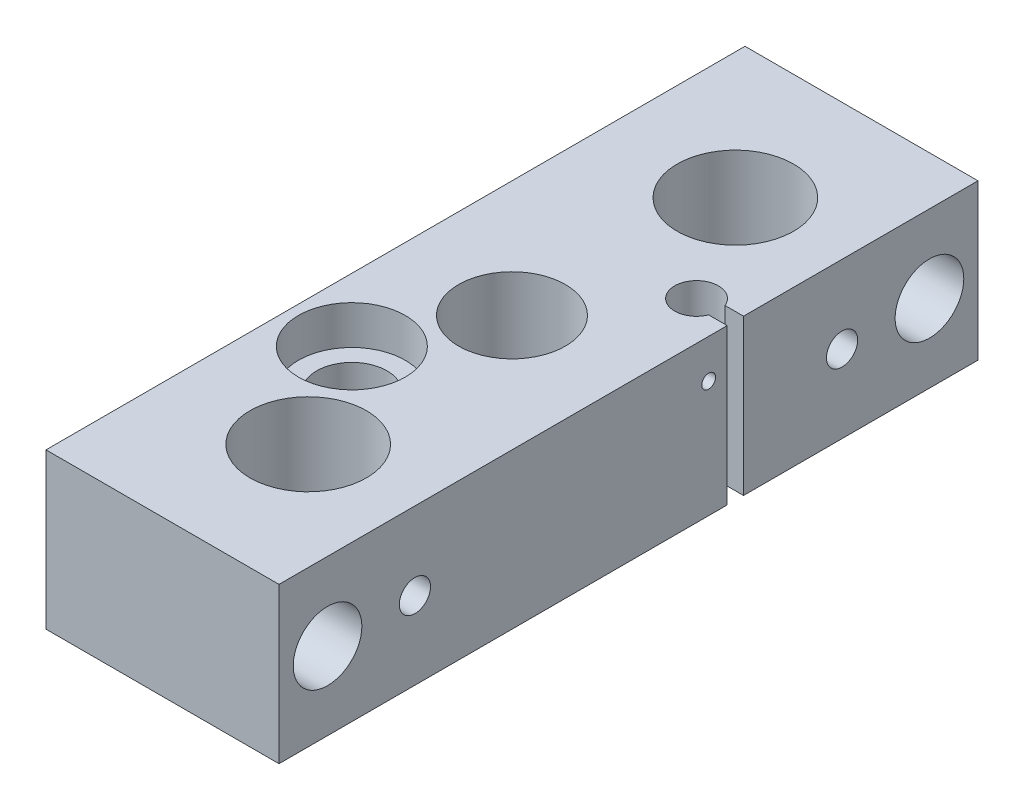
ISO-10303-21;
HEADER;
FILE_DESCRIPTION(('STEP AP214'),'2;1');
FILE_NAME('part.step','',(''),(''),'','','');
FILE_SCHEMA(('AUTOMOTIVE_DESIGN { 1 0 10303 214 1 1 1 1 }'));
ENDSEC;
DATA;
#1=APPLICATION_CONTEXT('core data for automotive mechanical design processes');
#2=APPLICATION_PROTOCOL_DEFINITION('international standard','automotive_design',2000,#1);
#3=PRODUCT_CONTEXT('',#1,'mechanical');
#4=PRODUCT('Part','Part','',(#3));
#5=PRODUCT_RELATED_PRODUCT_CATEGORY('part','',(#4));
#6=PRODUCT_DEFINITION_FORMATION('','',#4);
#7=PRODUCT_DEFINITION_CONTEXT('part definition',#1,'design');
#8=PRODUCT_DEFINITION('design','',#6,#7);
#9=PRODUCT_DEFINITION_SHAPE('','',#8);
#10=(LENGTH_UNIT() NAMED_UNIT(*) SI_UNIT(.MILLI.,.METRE.));
#11=(NAMED_UNIT(*) PLANE_ANGLE_UNIT() SI_UNIT($,.RADIAN.));
#12=(NAMED_UNIT(*) SI_UNIT($,.STERADIAN.) SOLID_ANGLE_UNIT());
#13=UNCERTAINTY_MEASURE_WITH_UNIT(LENGTH_MEASURE(1.E-05),#10,'distance_accuracy_value','');
#14=(GEOMETRIC_REPRESENTATION_CONTEXT(3) GLOBAL_UNCERTAINTY_ASSIGNED_CONTEXT((#13)) GLOBAL_UNIT_ASSIGNED_CONTEXT((#10,
#11,#12)) REPRESENTATION_CONTEXT('',''));
#15=CARTESIAN_POINT('',(0.,0.,0.));
#16=DIRECTION('',(0.,0.,1.));
#17=DIRECTION('',(1.,0.,0.));
#18=AXIS2_PLACEMENT_3D('',#15,#16,#17);
#19=CARTESIAN_POINT('',(19.05,12.7,-57.15));
#20=DIRECTION('',(-1.,0.,0.));
#21=DIRECTION('',(0.,0.,1.));
#22=AXIS2_PLACEMENT_3D('',#19,#20,#21);
#23=PLANE('',#22);
#24=CARTESIAN_POINT('',(19.05,0.,-34.925));
#25=DIRECTION('',(1.,0.,0.));
#26=DIRECTION('',(0.,0.,-1.));
#27=AXIS2_PLACEMENT_3D('',#24,#25,#26);
#28=CIRCLE('',#27,2.55269999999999);
#29=CARTESIAN_POINT('',(19.05,0.,-37.4777));
#30=VERTEX_POINT('',#29);
#31=EDGE_CURVE('E222',#30,#30,#28,.T.);
#32=ORIENTED_EDGE('',*,*,#31,.F.);
#33=EDGE_LOOP('',(#32));
#34=FACE_BOUND('',#33,.T.);
#35=CARTESIAN_POINT('',(19.05,0.,-49.2125));
#36=DIRECTION('',(1.,0.,0.));
#37=DIRECTION('',(0.,0.,-1.));
#38=AXIS2_PLACEMENT_3D('',#35,#36,#37);
#39=CIRCLE('',#38,5.61339999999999);
#40=CARTESIAN_POINT('',(19.05,0.,-54.8259));
#41=VERTEX_POINT('',#40);
#42=EDGE_CURVE('E197',#41,#41,#39,.T.);
#43=ORIENTED_EDGE('',*,*,#42,.F.);
#44=EDGE_LOOP('',(#43));
#45=FACE_BOUND('',#44,.T.);
#46=DIRECTION('',(0.,0.,-1.));
#47=VECTOR('',#46,1.);
#48=CARTESIAN_POINT('',(19.05,12.7,-57.15));
#49=LINE('',#48,#47);
#50=CARTESIAN_POINT('',(19.05,12.7,-18.8109262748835));
#51=VERTEX_POINT('',#50);
#52=CARTESIAN_POINT('',(19.05,12.7,-57.15));
#53=VERTEX_POINT('',#52);
#54=EDGE_CURVE('E380',#51,#53,#49,.T.);
#55=ORIENTED_EDGE('',*,*,#54,.F.);
#56=DIRECTION('',(0.,1.,0.));
#57=VECTOR('',#56,1.);
#58=CARTESIAN_POINT('',(19.05,-12.7,-18.8109262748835));
#59=LINE('',#58,#57);
#60=CARTESIAN_POINT('',(19.05,-12.7,-18.8109262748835));
#61=VERTEX_POINT('',#60);
#62=EDGE_CURVE('E151',#61,#51,#59,.T.);
#63=ORIENTED_EDGE('',*,*,#62,.F.);
#64=DIRECTION('',(0.,0.,-1.));
#65=VECTOR('',#64,1.);
#66=CARTESIAN_POINT('',(19.05,-12.7,-57.15));
#67=LINE('',#66,#65);
#68=CARTESIAN_POINT('',(19.05,-12.7,-57.15));
#69=VERTEX_POINT('',#68);
#70=EDGE_CURVE('E335',#61,#69,#67,.T.);
#71=ORIENTED_EDGE('',*,*,#70,.T.);
#72=DIRECTION('',(0.,-1.,0.));
#73=VECTOR('',#72,1.);
#74=CARTESIAN_POINT('',(19.05,12.7,-57.15));
#75=LINE('',#74,#73);
#76=EDGE_CURVE('E345',#53,#69,#75,.T.);
#77=ORIENTED_EDGE('',*,*,#76,.F.);
#78=EDGE_LOOP('',(#55,#63,#71,#77));
#79=FACE_BOUND('',#78,.T.);
#80=ADVANCED_FACE('F37',(#34,#45,#79),#23,.F.);
#81=CARTESIAN_POINT('',(-19.05,12.7,-57.15));
#82=DIRECTION('',(1.,0.,0.));
#83=DIRECTION('',(0.,0.,-1.));
#84=AXIS2_PLACEMENT_3D('',#81,#82,#83);
#85=PLANE('',#84);
#86=CARTESIAN_POINT('',(-19.05,0.,-49.2125));
#87=DIRECTION('',(1.,0.,0.));
#88=DIRECTION('',(0.,0.,-1.));
#89=AXIS2_PLACEMENT_3D('',#86,#87,#88);
#90=CIRCLE('',#89,4.21639999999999);
#91=CARTESIAN_POINT('',(-19.05,0.,-53.4289));
#92=VERTEX_POINT('',#91);
#93=EDGE_CURVE('E186',#92,#92,#90,.T.);
#94=ORIENTED_EDGE('',*,*,#93,.T.);
#95=EDGE_LOOP('',(#94));
#96=FACE_BOUND('',#95,.T.);
#97=CARTESIAN_POINT('',(-19.05,0.,49.2125));
#98=DIRECTION('',(1.,0.,0.));
#99=DIRECTION('',(0.,0.,-1.));
#100=AXIS2_PLACEMENT_3D('',#97,#98,#99);
#101=CIRCLE('',#100,4.21639999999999);
#102=CARTESIAN_POINT('',(-19.05,0.,44.9961));
#103=VERTEX_POINT('',#102);
#104=EDGE_CURVE('E200',#103,#103,#101,.T.);
#105=ORIENTED_EDGE('',*,*,#104,.T.);
#106=EDGE_LOOP('',(#105));
#107=FACE_BOUND('',#106,.T.);
#108=DIRECTION('',(0.,0.,1.));
#109=VECTOR('',#108,1.);
#110=CARTESIAN_POINT('',(-19.05,-12.7,-57.15));
#111=LINE('',#110,#109);
#112=CARTESIAN_POINT('',(-19.05,-12.7,-57.15));
#113=VERTEX_POINT('',#112);
#114=CARTESIAN_POINT('',(-19.05,-12.7,57.15));
#115=VERTEX_POINT('',#114);
#116=EDGE_CURVE('E372',#113,#115,#111,.T.);
#117=ORIENTED_EDGE('',*,*,#116,.T.);
#118=DIRECTION('',(0.,-1.,0.));
#119=VECTOR('',#118,1.);
#120=CARTESIAN_POINT('',(-19.05,12.7,57.15));
#121=LINE('',#120,#119);
#122=CARTESIAN_POINT('',(-19.05,12.7,57.15));
#123=VERTEX_POINT('',#122);
#124=EDGE_CURVE('E11',#123,#115,#121,.T.);
#125=ORIENTED_EDGE('',*,*,#124,.F.);
#126=DIRECTION('',(0.,0.,1.));
#127=VECTOR('',#126,1.);
#128=CARTESIAN_POINT('',(-19.05,12.7,-57.15));
#129=LINE('',#128,#127);
#130=CARTESIAN_POINT('',(-19.05,12.7,-57.15));
#131=VERTEX_POINT('',#130);
#132=EDGE_CURVE('E337',#131,#123,#129,.T.);
#133=ORIENTED_EDGE('',*,*,#132,.F.);
#134=DIRECTION('',(0.,-1.,0.));
#135=VECTOR('',#134,1.);
#136=CARTESIAN_POINT('',(-19.05,12.7,-57.15));
#137=LINE('',#136,#135);
#138=EDGE_CURVE('E343',#131,#113,#137,.T.);
#139=ORIENTED_EDGE('',*,*,#138,.T.);
#140=EDGE_LOOP('',(#117,#125,#133,#139));
#141=FACE_BOUND('',#140,.T.);
#142=ADVANCED_FACE('F39',(#96,#107,#141),#85,.F.);
#143=CARTESIAN_POINT('',(-19.05,12.7,57.15));
#144=DIRECTION('',(0.,0.,-1.));
#145=DIRECTION('',(-1.,0.,0.));
#146=AXIS2_PLACEMENT_3D('',#143,#144,#145);
#147=PLANE('',#146);
#148=DIRECTION('',(1.,0.,0.));
#149=VECTOR('',#148,1.);
#150=CARTESIAN_POINT('',(-19.05,-12.7,57.15));
#151=LINE('',#150,#149);
#152=CARTESIAN_POINT('',(19.05,-12.7,57.15));
#153=VERTEX_POINT('',#152);
#154=EDGE_CURVE('E339',#115,#153,#151,.T.);
#155=ORIENTED_EDGE('',*,*,#154,.T.);
#156=DIRECTION('',(0.,-1.,0.));
#157=VECTOR('',#156,1.);
#158=CARTESIAN_POINT('',(19.05,12.7,57.15));
#159=LINE('',#158,#157);
#160=CARTESIAN_POINT('',(19.05,12.7,57.15));
#161=VERTEX_POINT('',#160);
#162=EDGE_CURVE('E50',#161,#153,#159,.T.);
#163=ORIENTED_EDGE('',*,*,#162,.F.);
#164=DIRECTION('',(1.,0.,0.));
#165=VECTOR('',#164,1.);
#166=CARTESIAN_POINT('',(-19.05,12.7,57.15));
#167=LINE('',#166,#165);
#168=EDGE_CURVE('E95',#123,#161,#167,.T.);
#169=ORIENTED_EDGE('',*,*,#168,.F.);
#170=ORIENTED_EDGE('',*,*,#124,.T.);
#171=EDGE_LOOP('',(#155,#163,#169,#170));
#172=FACE_BOUND('',#171,.T.);
#173=ADVANCED_FACE('F312',(#172),#147,.F.);
#174=CARTESIAN_POINT('',(19.05,6.35,-13.1064));
#175=DIRECTION('',(1.,0.,0.));
#176=DIRECTION('',(0.,0.,-1.));
#177=AXIS2_PLACEMENT_3D('',#174,#175,#176);
#178=CIRCLE('',#177,1.13029999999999);
#179=CARTESIAN_POINT('',(19.05,6.35,-14.2367));
#180=VERTEX_POINT('',#179);
#181=EDGE_CURVE('E157',#180,#180,#178,.T.);
#182=ORIENTED_EDGE('',*,*,#181,.F.);
#183=EDGE_LOOP('',(#182));
#184=FACE_BOUND('',#183,.T.);
#185=CARTESIAN_POINT('',(19.05,0.,49.2125));
#186=DIRECTION('',(1.,0.,0.));
#187=DIRECTION('',(0.,0.,-1.));
#188=AXIS2_PLACEMENT_3D('',#185,#186,#187);
#189=CIRCLE('',#188,5.61339999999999);
#190=CARTESIAN_POINT('',(19.05,0.,43.5991));
#191=VERTEX_POINT('',#190);
#192=EDGE_CURVE('E209',#191,#191,#189,.T.);
#193=ORIENTED_EDGE('',*,*,#192,.F.);
#194=EDGE_LOOP('',(#193));
#195=FACE_BOUND('',#194,.T.);
#196=CARTESIAN_POINT('',(19.05,0.,34.925));
#197=DIRECTION('',(1.,0.,0.));
#198=DIRECTION('',(0.,0.,-1.));
#199=AXIS2_PLACEMENT_3D('',#196,#197,#198);
#200=CIRCLE('',#199,2.55269999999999);
#201=CARTESIAN_POINT('',(19.05,0.,32.3723));
#202=VERTEX_POINT('',#201);
#203=EDGE_CURVE('E212',#202,#202,#200,.T.);
#204=ORIENTED_EDGE('',*,*,#203,.F.);
#205=EDGE_LOOP('',(#204));
#206=FACE_BOUND('',#205,.T.);
#207=CARTESIAN_POINT('',(19.05,-12.7,-16.1394737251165));
#208=VERTEX_POINT('',#207);
#209=EDGE_CURVE('E332',#153,#208,#67,.T.);
#210=ORIENTED_EDGE('',*,*,#209,.T.);
#211=DIRECTION('',(0.,1.,0.));
#212=VECTOR('',#211,1.);
#213=CARTESIAN_POINT('',(19.05,-12.7,-16.1394737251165));
#214=LINE('',#213,#212);
#215=CARTESIAN_POINT('',(19.05,12.7,-16.1394737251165));
#216=VERTEX_POINT('',#215);
#217=EDGE_CURVE('E58',#208,#216,#214,.T.);
#218=ORIENTED_EDGE('',*,*,#217,.T.);
#219=EDGE_CURVE('E381',#161,#216,#49,.T.);
#220=ORIENTED_EDGE('',*,*,#219,.F.);
#221=ORIENTED_EDGE('',*,*,#162,.T.);
#222=EDGE_LOOP('',(#210,#218,#220,#221));
#223=FACE_BOUND('',#222,.T.);
#224=ADVANCED_FACE('F308',(#184,#195,#206,#223),#23,.F.);
#225=CARTESIAN_POINT('',(-19.05,12.7,-57.15));
#226=DIRECTION('',(0.,0.,1.));
#227=DIRECTION('',(1.,0.,0.));
#228=AXIS2_PLACEMENT_3D('',#225,#226,#227);
#229=PLANE('',#228);
#230=DIRECTION('',(-1.,0.,0.));
#231=VECTOR('',#230,1.);
#232=CARTESIAN_POINT('',(-19.05,-12.7,-57.15));
#233=LINE('',#232,#231);
#234=EDGE_CURVE('E88',#69,#113,#233,.T.);
#235=ORIENTED_EDGE('',*,*,#234,.T.);
#236=ORIENTED_EDGE('',*,*,#138,.F.);
#237=DIRECTION('',(-1.,0.,0.));
#238=VECTOR('',#237,1.);
#239=CARTESIAN_POINT('',(-19.05,12.7,-57.15));
#240=LINE('',#239,#238);
#241=EDGE_CURVE('E67',#53,#131,#240,.T.);
#242=ORIENTED_EDGE('',*,*,#241,.F.);
#243=ORIENTED_EDGE('',*,*,#76,.T.);
#244=EDGE_LOOP('',(#235,#236,#242,#243));
#245=FACE_BOUND('',#244,.T.);
#246=ADVANCED_FACE('F318',(#245),#229,.F.);
#247=CARTESIAN_POINT('',(-19.05,12.7,-57.15));
#248=DIRECTION('',(0.,1.,0.));
#249=DIRECTION('',(0.,0.,1.));
#250=AXIS2_PLACEMENT_3D('',#247,#248,#249);
#251=PLANE('',#250);
#252=DIRECTION('',(-1.,0.,0.));
#253=VECTOR('',#252,1.);
#254=CARTESIAN_POINT('',(19.05,12.7,-18.8109262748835));
#255=LINE('',#254,#253);
#256=CARTESIAN_POINT('',(16.0202041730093,12.7,-18.8109262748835));
#257=VERTEX_POINT('',#256);
#258=EDGE_CURVE('E140',#51,#257,#255,.T.);
#259=ORIENTED_EDGE('',*,*,#258,.F.);
#260=ORIENTED_EDGE('',*,*,#54,.T.);
#261=ORIENTED_EDGE('',*,*,#241,.T.);
#262=ORIENTED_EDGE('',*,*,#132,.T.);
#263=ORIENTED_EDGE('',*,*,#168,.T.);
#264=ORIENTED_EDGE('',*,*,#219,.T.);
#265=DIRECTION('',(1.,0.,0.));
#266=VECTOR('',#265,1.);
#267=CARTESIAN_POINT('',(19.05,12.7,-16.1394737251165));
#268=LINE('',#267,#266);
#269=CARTESIAN_POINT('',(16.0202041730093,12.7,-16.1394737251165));
#270=VERTEX_POINT('',#269);
#271=EDGE_CURVE('E143',#270,#216,#268,.T.);
#272=ORIENTED_EDGE('',*,*,#271,.F.);
#273=CARTESIAN_POINT('',(12.7,12.7,-17.4752));
#274=DIRECTION('',(0.,1.,0.));
#275=DIRECTION('',(0.,0.,1.));
#276=AXIS2_PLACEMENT_3D('',#273,#274,#275);
#277=CIRCLE('',#276,3.57881550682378);
#278=EDGE_CURVE('E128',#257,#270,#277,.T.);
#279=ORIENTED_EDGE('',*,*,#278,.F.);
#280=EDGE_LOOP('',(#259,#260,#261,#262,#263,#264,#272,#279));
#281=FACE_BOUND('',#280,.T.);
#282=CARTESIAN_POINT('',(0.,12.7,0.));
#283=DIRECTION('',(0.,1.,0.));
#284=DIRECTION('',(0.,0.,1.));
#285=AXIS2_PLACEMENT_3D('',#282,#283,#284);
#286=CIRCLE('',#285,8.73125);
#287=CARTESIAN_POINT('',(0.,12.7,8.73125));
#288=VERTEX_POINT('',#287);
#289=EDGE_CURVE('E174',#288,#288,#286,.T.);
#290=ORIENTED_EDGE('',*,*,#289,.F.);
#291=EDGE_LOOP('',(#290));
#292=FACE_BOUND('',#291,.T.);
#293=CARTESIAN_POINT('',(-8.7122,12.7,17.4752));
#294=DIRECTION('',(0.,1.,0.));
#295=DIRECTION('',(0.,0.,1.));
#296=AXIS2_PLACEMENT_3D('',#293,#294,#295);
#297=CIRCLE('',#296,8.73760000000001);
#298=CARTESIAN_POINT('',(-8.7122,12.7,26.2128));
#299=VERTEX_POINT('',#298);
#300=EDGE_CURVE('E182',#299,#299,#297,.T.);
#301=ORIENTED_EDGE('',*,*,#300,.F.);
#302=EDGE_LOOP('',(#301));
#303=FACE_BOUND('',#302,.T.);
#304=CARTESIAN_POINT('',(1.6002,12.7,-34.925));
#305=DIRECTION('',(0.,1.,0.));
#306=DIRECTION('',(0.,0.,-1.));
#307=AXIS2_PLACEMENT_3D('',#304,#305,#306);
#308=CIRCLE('',#307,9.525);
#309=CARTESIAN_POINT('',(1.6002,12.7,-44.45));
#310=VERTEX_POINT('',#309);
#311=EDGE_CURVE('E363',#310,#310,#308,.T.);
#312=ORIENTED_EDGE('',*,*,#311,.F.);
#313=EDGE_LOOP('',(#312));
#314=FACE_BOUND('',#313,.T.);
#315=CARTESIAN_POINT('',(1.6002,12.7,34.925));
#316=DIRECTION('',(0.,1.,0.));
#317=DIRECTION('',(0.,0.,1.));
#318=AXIS2_PLACEMENT_3D('',#315,#316,#317);
#319=CIRCLE('',#318,9.525);
#320=CARTESIAN_POINT('',(1.6002,12.7,44.45));
#321=VERTEX_POINT('',#320);
#322=EDGE_CURVE('E366',#321,#321,#319,.T.);
#323=ORIENTED_EDGE('',*,*,#322,.F.);
#324=EDGE_LOOP('',(#323));
#325=FACE_BOUND('',#324,.T.);
#326=ADVANCED_FACE('F324',(#281,#292,#303,#314,#325),#251,.T.);
#327=CARTESIAN_POINT('',(-19.05,-12.7,-57.15));
#328=DIRECTION('',(0.,1.,0.));
#329=DIRECTION('',(0.,0.,1.));
#330=AXIS2_PLACEMENT_3D('',#327,#328,#329);
#331=PLANE('',#330);
#332=CARTESIAN_POINT('',(0.,-12.7,0.));
#333=DIRECTION('',(0.,-1.,0.));
#334=DIRECTION('',(0.,0.,-1.));
#335=AXIS2_PLACEMENT_3D('',#332,#333,#334);
#336=CIRCLE('',#335,4.74472);
#337=CARTESIAN_POINT('',(0.,-12.7,-4.74472));
#338=VERTEX_POINT('',#337);
#339=EDGE_CURVE('E166',#338,#338,#336,.T.);
#340=ORIENTED_EDGE('',*,*,#339,.F.);
#341=EDGE_LOOP('',(#340));
#342=FACE_BOUND('',#341,.T.);
#343=CARTESIAN_POINT('',(-8.7122,-12.7,17.4752));
#344=DIRECTION('',(0.,1.,0.));
#345=DIRECTION('',(0.,0.,1.));
#346=AXIS2_PLACEMENT_3D('',#343,#344,#345);
#347=CIRCLE('',#346,5.75436999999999);
#348=CARTESIAN_POINT('',(-8.7122,-12.7,23.22957));
#349=VERTEX_POINT('',#348);
#350=EDGE_CURVE('E173',#349,#349,#347,.T.);
#351=ORIENTED_EDGE('',*,*,#350,.T.);
#352=EDGE_LOOP('',(#351));
#353=FACE_BOUND('',#352,.T.);
#354=CARTESIAN_POINT('',(1.6002,-12.7,-34.925));
#355=DIRECTION('',(0.,1.,0.));
#356=DIRECTION('',(0.,0.,-1.));
#357=AXIS2_PLACEMENT_3D('',#354,#355,#356);
#358=CIRCLE('',#357,9.525);
#359=CARTESIAN_POINT('',(1.6002,-12.7,-44.45));
#360=VERTEX_POINT('',#359);
#361=EDGE_CURVE('E369',#360,#360,#358,.T.);
#362=ORIENTED_EDGE('',*,*,#361,.T.);
#363=EDGE_LOOP('',(#362));
#364=FACE_BOUND('',#363,.T.);
#365=CARTESIAN_POINT('',(1.6002,-12.7,34.925));
#366=DIRECTION('',(0.,1.,0.));
#367=DIRECTION('',(0.,0.,1.));
#368=AXIS2_PLACEMENT_3D('',#365,#366,#367);
#369=CIRCLE('',#368,9.525);
#370=CARTESIAN_POINT('',(1.6002,-12.7,44.45));
#371=VERTEX_POINT('',#370);
#372=EDGE_CURVE('E368',#371,#371,#369,.T.);
#373=ORIENTED_EDGE('',*,*,#372,.T.);
#374=EDGE_LOOP('',(#373));
#375=FACE_BOUND('',#374,.T.);
#376=ORIENTED_EDGE('',*,*,#70,.F.);
#377=DIRECTION('',(-1.,0.,0.));
#378=VECTOR('',#377,1.);
#379=CARTESIAN_POINT('',(19.05,-12.7,-18.8109262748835));
#380=LINE('',#379,#378);
#381=CARTESIAN_POINT('',(16.0202041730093,-12.7,-18.8109262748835));
#382=VERTEX_POINT('',#381);
#383=EDGE_CURVE('E130',#61,#382,#380,.T.);
#384=ORIENTED_EDGE('',*,*,#383,.T.);
#385=CARTESIAN_POINT('',(12.7,-12.7,-17.4752));
#386=DIRECTION('',(0.,1.,0.));
#387=DIRECTION('',(0.,0.,1.));
#388=AXIS2_PLACEMENT_3D('',#385,#386,#387);
#389=CIRCLE('',#388,3.57881550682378);
#390=CARTESIAN_POINT('',(16.0202041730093,-12.7,-16.1394737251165));
#391=VERTEX_POINT('',#390);
#392=EDGE_CURVE('E125',#382,#391,#389,.T.);
#393=ORIENTED_EDGE('',*,*,#392,.T.);
#394=DIRECTION('',(1.,0.,0.));
#395=VECTOR('',#394,1.);
#396=CARTESIAN_POINT('',(19.05,-12.7,-16.1394737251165));
#397=LINE('',#396,#395);
#398=EDGE_CURVE('E132',#391,#208,#397,.T.);
#399=ORIENTED_EDGE('',*,*,#398,.T.);
#400=ORIENTED_EDGE('',*,*,#209,.F.);
#401=ORIENTED_EDGE('',*,*,#154,.F.);
#402=ORIENTED_EDGE('',*,*,#116,.F.);
#403=ORIENTED_EDGE('',*,*,#234,.F.);
#404=EDGE_LOOP('',(#376,#384,#393,#399,#400,#401,#402,#403));
#405=FACE_BOUND('',#404,.T.);
#406=ADVANCED_FACE('F139',(#342,#353,#364,#375,#405),#331,.F.);
#407=CARTESIAN_POINT('',(1.6002,-12.7,34.925));
#408=DIRECTION('',(0.,1.,0.));
#409=DIRECTION('',(0.,0.,1.));
#410=AXIS2_PLACEMENT_3D('',#407,#408,#409);
#411=CYLINDRICAL_SURFACE('',#410,9.525);
#412=CARTESIAN_POINT('',(10.7767651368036,0.,32.3723));
#413=CARTESIAN_POINT('',(10.7767675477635,0.140595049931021,32.3723033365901));
#414=CARTESIAN_POINT('',(10.7800315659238,0.281225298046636,32.3839548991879));
#415=CARTESIAN_POINT('',(10.7926954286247,0.558422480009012,32.4301637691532));
#416=CARTESIAN_POINT('',(10.8020983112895,0.694987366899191,32.4647324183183));
#417=CARTESIAN_POINT('',(10.8259001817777,0.960003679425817,32.5555560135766));
#418=CARTESIAN_POINT('',(10.8402920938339,1.08846629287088,32.6117802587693));
#419=CARTESIAN_POINT('',(10.8724413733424,1.33415616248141,32.7442226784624));
#420=CARTESIAN_POINT('',(10.8901990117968,1.45138251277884,32.820442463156));
#421=CARTESIAN_POINT('',(10.9275816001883,1.6742337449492,32.9927714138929));
#422=CARTESIAN_POINT('',(10.9472399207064,1.77953274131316,33.0892948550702));
#423=CARTESIAN_POINT('',(10.9859209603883,1.97265853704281,33.2986003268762));
#424=CARTESIAN_POINT('',(11.0049436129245,2.06048350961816,33.4113840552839));
#425=CARTESIAN_POINT('',(11.040582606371,2.21752928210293,33.6522705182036));
#426=CARTESIAN_POINT('',(11.057154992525,2.28642578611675,33.7805917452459));
#427=CARTESIAN_POINT('',(11.0856431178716,2.4015434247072,34.0475146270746));
#428=CARTESIAN_POINT('',(11.0975596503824,2.44776842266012,34.1861145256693));
#429=CARTESIAN_POINT('',(11.1151574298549,2.51517528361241,34.4662585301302));
#430=CARTESIAN_POINT('',(11.1209765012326,2.53691157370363,34.6076604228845));
#431=CARTESIAN_POINT('',(11.1262057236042,2.55646866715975,34.892215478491));
#432=CARTESIAN_POINT('',(11.1256169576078,2.55429351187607,35.0353683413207));
#433=CARTESIAN_POINT('',(11.1181976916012,2.52647919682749,35.31550156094));
#434=CARTESIAN_POINT('',(11.1115265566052,2.50143909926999,35.4525462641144));
#435=CARTESIAN_POINT('',(11.0928803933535,2.42957391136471,35.7204124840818));
#436=CARTESIAN_POINT('',(11.0809050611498,2.38274757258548,35.8512336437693));
#437=CARTESIAN_POINT('',(11.0527602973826,2.26818204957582,36.1044645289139));
#438=CARTESIAN_POINT('',(11.0365500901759,2.20023825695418,36.2267769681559));
#439=CARTESIAN_POINT('',(11.0016811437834,2.04552371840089,36.4584680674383));
#440=CARTESIAN_POINT('',(10.9830219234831,1.95874927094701,36.5678441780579));
#441=CARTESIAN_POINT('',(10.9445936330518,1.76565925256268,36.7741335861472));
#442=CARTESIAN_POINT('',(10.9248080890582,1.65882130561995,36.8705554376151));
#443=CARTESIAN_POINT('',(10.8868783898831,1.43028755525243,37.0442342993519));
#444=CARTESIAN_POINT('',(10.868734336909,1.30859082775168,37.1214901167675));
#445=CARTESIAN_POINT('',(10.8360753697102,1.05271982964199,37.2550230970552));
#446=CARTESIAN_POINT('',(10.8215839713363,0.91847197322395,37.3111654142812));
#447=CARTESIAN_POINT('',(10.7981626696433,0.641957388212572,37.3999218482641));
#448=CARTESIAN_POINT('',(10.7892313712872,0.499692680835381,37.4325418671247));
#449=CARTESIAN_POINT('',(10.7782390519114,0.21578199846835,37.4724778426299));
#450=CARTESIAN_POINT('',(10.7759789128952,0.0742468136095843,37.4805274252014));
#451=CARTESIAN_POINT('',(10.778039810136,-0.208147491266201,37.4731163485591));
#452=CARTESIAN_POINT('',(10.782360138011,-0.349006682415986,37.4576582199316));
#453=CARTESIAN_POINT('',(10.7969027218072,-0.623215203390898,37.4043175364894));
#454=CARTESIAN_POINT('',(10.8070085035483,-0.756657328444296,37.3668771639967));
#455=CARTESIAN_POINT('',(10.8318692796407,-1.01536753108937,37.2711325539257));
#456=CARTESIAN_POINT('',(10.8466248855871,-1.14063453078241,37.2128255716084));
#457=CARTESIAN_POINT('',(10.8795305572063,-1.38250471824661,37.0755172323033));
#458=CARTESIAN_POINT('',(10.8977486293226,-1.49885423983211,36.9960857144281));
#459=CARTESIAN_POINT('',(10.935367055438,-1.71684210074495,36.8193154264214));
#460=CARTESIAN_POINT('',(10.9547676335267,-1.81847763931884,36.7219732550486));
#461=CARTESIAN_POINT('',(10.9932514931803,-2.0072040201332,36.5087493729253));
#462=CARTESIAN_POINT('',(11.0123089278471,-2.09378293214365,36.392408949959));
#463=CARTESIAN_POINT('',(11.0473777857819,-2.24618302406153,36.1464206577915));
#464=CARTESIAN_POINT('',(11.0633893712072,-2.31200530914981,36.0167734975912));
#465=CARTESIAN_POINT('',(11.0904592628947,-2.42041735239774,35.7487646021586));
#466=CARTESIAN_POINT('',(11.1015545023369,-2.463180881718,35.6104770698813));
#467=CARTESIAN_POINT('',(11.1177041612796,-2.52476398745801,35.3283365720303));
#468=CARTESIAN_POINT('',(11.122759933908,-2.54358892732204,35.1844848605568));
#469=CARTESIAN_POINT('',(11.1261964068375,-2.55642167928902,34.9000800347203));
#470=CARTESIAN_POINT('',(11.1247790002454,-2.55118007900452,34.7595627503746));
#471=CARTESIAN_POINT('',(11.11588567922,-2.51777328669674,34.4814865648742));
#472=CARTESIAN_POINT('',(11.1084099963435,-2.48960897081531,34.3439275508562));
#473=CARTESIAN_POINT('',(11.0882808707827,-2.41158232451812,34.0765851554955));
#474=CARTESIAN_POINT('',(11.07566412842,-2.3618736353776,33.9467539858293));
#475=CARTESIAN_POINT('',(11.046571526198,-2.24230638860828,33.6972008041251));
#476=CARTESIAN_POINT('',(11.0300951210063,-2.17244498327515,33.5774802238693));
#477=CARTESIAN_POINT('',(10.9944923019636,-2.0123662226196,33.3480577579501));
#478=CARTESIAN_POINT('',(10.97530656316,-1.92165220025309,33.2387116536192));
#479=CARTESIAN_POINT('',(10.9366854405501,-1.72338339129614,33.0365401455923));
#480=CARTESIAN_POINT('',(10.9172499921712,-1.61582416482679,32.9437191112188));
#481=CARTESIAN_POINT('',(10.8798310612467,-1.38403596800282,32.7751843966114));
#482=CARTESIAN_POINT('',(10.8618895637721,-1.25948905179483,32.6998978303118));
#483=CARTESIAN_POINT('',(10.8300853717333,-0.999039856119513,32.5714390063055));
#484=CARTESIAN_POINT('',(10.816220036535,-0.863145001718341,32.5182524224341));
#485=CARTESIAN_POINT('',(10.7960427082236,-0.606479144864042,32.4423855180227));
#486=CARTESIAN_POINT('',(10.7888724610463,-0.486810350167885,32.4161655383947));
#487=CARTESIAN_POINT('',(10.7792329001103,-0.244769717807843,32.3811223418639));
#488=CARTESIAN_POINT('',(10.7767630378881,-0.122398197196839,32.3722970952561));
#489=CARTESIAN_POINT('',(10.7767651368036,0.,32.3723));
#490=B_SPLINE_CURVE_WITH_KNOTS('',3,(#412,#413,#414,#415,#416,#417,#418,#419,#420,#421,#422,
#423,#424,#425,#426,#427,#428,#429,#430,#431,#432,#433,#434,#435,#436,#437,#438,#439,#440,#441,
#442,#443,#444,#445,#446,#447,#448,#449,#450,#451,#452,#453,#454,#455,#456,#457,#458,#459,#460,
#461,#462,#463,#464,#465,#466,#467,#468,#469,#470,#471,#472,#473,#474,#475,#476,#477,#478,#479,
#480,#481,#482,#483,#484,#485,#486,#487,#488,#489),.UNSPECIFIED.,.T.,.F.,(4,2,2,2,2,2,2,2,2,2,2,
2,2,2,2,2,2,2,2,2,2,2,2,2,2,2,2,2,2,2,2,2,2,2,2,2,2,2,4),(0.,0.421335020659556,
0.842878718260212,1.26382698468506,1.68480915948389,2.11540048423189,2.54603680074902,
2.98364660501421,3.42118181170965,3.84859855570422,4.27594306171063,4.6924026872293,
5.10888618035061,5.52953789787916,5.95027237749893,6.38404937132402,6.81785335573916,
7.25438267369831,7.69080242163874,8.11405736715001,8.53726675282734,8.95224141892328,
9.36727068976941,9.79150173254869,10.2158134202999,10.6525267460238,11.0892168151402,
11.5225682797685,11.9558226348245,12.3756580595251,12.7954774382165,13.2123509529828,
13.6292834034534,14.0574224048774,14.4856744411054,14.9234656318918,15.3609725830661,
15.7278181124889,16.0946208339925),.UNSPECIFIED.);
#491=CARTESIAN_POINT('',(10.7767651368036,0.,32.3723));
#492=VERTEX_POINT('',#491);
#493=EDGE_CURVE('E215',#492,#492,#490,.T.);
#494=ORIENTED_EDGE('',*,*,#493,.T.);
#495=EDGE_LOOP('',(#494));
#496=FACE_BOUND('',#495,.T.);
#497=ORIENTED_EDGE('',*,*,#372,.F.);
#498=EDGE_LOOP('',(#497));
#499=FACE_BOUND('',#498,.T.);
#500=ORIENTED_EDGE('',*,*,#322,.T.);
#501=EDGE_LOOP('',(#500));
#502=FACE_BOUND('',#501,.T.);
#503=ADVANCED_FACE('F407',(#496,#499,#502),#411,.F.);
#504=CARTESIAN_POINT('',(1.6002,-12.7,-34.925));
#505=DIRECTION('',(0.,1.,0.));
#506=DIRECTION('',(0.,0.,1.));
#507=AXIS2_PLACEMENT_3D('',#504,#505,#506);
#508=CYLINDRICAL_SURFACE('',#507,9.525);
#509=CARTESIAN_POINT('',(10.7767651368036,0.,-37.4777));
#510=CARTESIAN_POINT('',(10.7767675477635,0.140595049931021,-37.4776966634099));
#511=CARTESIAN_POINT('',(10.7800315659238,0.281225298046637,-37.4660451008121));
#512=CARTESIAN_POINT('',(10.7926954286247,0.558422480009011,-37.4198362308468));
#513=CARTESIAN_POINT('',(10.8020983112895,0.694987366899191,-37.3852675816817));
#514=CARTESIAN_POINT('',(10.8259001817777,0.960003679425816,-37.2944439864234));
#515=CARTESIAN_POINT('',(10.8402920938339,1.08846629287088,-37.2382197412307));
#516=CARTESIAN_POINT('',(10.8724413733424,1.33415616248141,-37.1057773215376));
#517=CARTESIAN_POINT('',(10.8901990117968,1.45138251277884,-37.029557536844));
#518=CARTESIAN_POINT('',(10.9275816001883,1.6742337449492,-36.8572285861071));
#519=CARTESIAN_POINT('',(10.9472399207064,1.77953274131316,-36.7607051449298));
#520=CARTESIAN_POINT('',(10.9859209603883,1.97265853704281,-36.5513996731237));
#521=CARTESIAN_POINT('',(11.0049436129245,2.06048350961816,-36.4386159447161));
#522=CARTESIAN_POINT('',(11.040582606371,2.21752928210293,-36.1977294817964));
#523=CARTESIAN_POINT('',(11.057154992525,2.28642578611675,-36.0694082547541));
#524=CARTESIAN_POINT('',(11.0856431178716,2.4015434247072,-35.8024853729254));
#525=CARTESIAN_POINT('',(11.0975596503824,2.44776842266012,-35.6638854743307));
#526=CARTESIAN_POINT('',(11.1151574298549,2.51517528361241,-35.3837414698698));
#527=CARTESIAN_POINT('',(11.1209765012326,2.53691157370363,-35.2423395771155));
#528=CARTESIAN_POINT('',(11.1262057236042,2.55646866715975,-34.957784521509));
#529=CARTESIAN_POINT('',(11.1256169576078,2.55429351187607,-34.8146316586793));
#530=CARTESIAN_POINT('',(11.1181976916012,2.52647919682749,-34.53449843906));
#531=CARTESIAN_POINT('',(11.1115265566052,2.50143909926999,-34.3974537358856));
#532=CARTESIAN_POINT('',(11.0928803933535,2.42957391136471,-34.1295875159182));
#533=CARTESIAN_POINT('',(11.0809050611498,2.38274757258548,-33.9987663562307));
#534=CARTESIAN_POINT('',(11.0527602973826,2.26818204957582,-33.7455354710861));
#535=CARTESIAN_POINT('',(11.0365500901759,2.20023825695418,-33.6232230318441));
#536=CARTESIAN_POINT('',(11.0016811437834,2.04552371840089,-33.3915319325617));
#537=CARTESIAN_POINT('',(10.9830219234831,1.95874927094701,-33.2821558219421));
#538=CARTESIAN_POINT('',(10.9445936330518,1.76565925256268,-33.0758664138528));
#539=CARTESIAN_POINT('',(10.9248080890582,1.65882130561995,-32.9794445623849));
#540=CARTESIAN_POINT('',(10.8868783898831,1.43028755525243,-32.8057657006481));
#541=CARTESIAN_POINT('',(10.868734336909,1.30859082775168,-32.7285098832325));
#542=CARTESIAN_POINT('',(10.8360753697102,1.05271982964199,-32.5949769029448));
#543=CARTESIAN_POINT('',(10.8215839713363,0.91847197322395,-32.5388345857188));
#544=CARTESIAN_POINT('',(10.7981626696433,0.641957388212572,-32.4500781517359));
#545=CARTESIAN_POINT('',(10.7892313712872,0.499692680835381,-32.4174581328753));
#546=CARTESIAN_POINT('',(10.7782390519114,0.21578199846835,-32.3775221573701));
#547=CARTESIAN_POINT('',(10.7759789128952,0.0742468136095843,-32.3694725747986));
#548=CARTESIAN_POINT('',(10.778039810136,-0.208147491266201,-32.3768836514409));
#549=CARTESIAN_POINT('',(10.782360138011,-0.349006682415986,-32.3923417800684));
#550=CARTESIAN_POINT('',(10.7969027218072,-0.623215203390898,-32.4456824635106));
#551=CARTESIAN_POINT('',(10.8070085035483,-0.756657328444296,-32.4831228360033));
#552=CARTESIAN_POINT('',(10.8318692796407,-1.01536753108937,-32.5788674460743));
#553=CARTESIAN_POINT('',(10.8466248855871,-1.14063453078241,-32.6371744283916));
#554=CARTESIAN_POINT('',(10.8795305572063,-1.38250471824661,-32.7744827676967));
#555=CARTESIAN_POINT('',(10.8977486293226,-1.4988542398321,-32.8539142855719));
#556=CARTESIAN_POINT('',(10.935367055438,-1.71684210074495,-33.0306845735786));
#557=CARTESIAN_POINT('',(10.9547676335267,-1.81847763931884,-33.1280267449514));
#558=CARTESIAN_POINT('',(10.9932514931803,-2.0072040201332,-33.3412506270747));
#559=CARTESIAN_POINT('',(11.0123089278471,-2.09378293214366,-33.457591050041));
#560=CARTESIAN_POINT('',(11.0473777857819,-2.24618302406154,-33.7035793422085));
#561=CARTESIAN_POINT('',(11.0633893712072,-2.31200530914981,-33.8332265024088));
#562=CARTESIAN_POINT('',(11.0904592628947,-2.42041735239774,-34.1012353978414));
#563=CARTESIAN_POINT('',(11.1015545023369,-2.463180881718,-34.2395229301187));
#564=CARTESIAN_POINT('',(11.1177041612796,-2.52476398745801,-34.5216634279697));
#565=CARTESIAN_POINT('',(11.122759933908,-2.54358892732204,-34.6655151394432));
#566=CARTESIAN_POINT('',(11.1261964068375,-2.55642167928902,-34.9499199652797));
#567=CARTESIAN_POINT('',(11.1247790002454,-2.55118007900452,-35.0904372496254));
#568=CARTESIAN_POINT('',(11.11588567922,-2.51777328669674,-35.3685134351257));
#569=CARTESIAN_POINT('',(11.1084099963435,-2.48960897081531,-35.5060724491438));
#570=CARTESIAN_POINT('',(11.0882808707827,-2.41158232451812,-35.7734148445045));
#571=CARTESIAN_POINT('',(11.07566412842,-2.3618736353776,-35.9032460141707));
#572=CARTESIAN_POINT('',(11.046571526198,-2.24230638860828,-36.1527991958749));
#573=CARTESIAN_POINT('',(11.0300951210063,-2.17244498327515,-36.2725197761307));
#574=CARTESIAN_POINT('',(10.9944923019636,-2.0123662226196,-36.5019422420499));
#575=CARTESIAN_POINT('',(10.97530656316,-1.92165220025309,-36.6112883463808));
#576=CARTESIAN_POINT('',(10.9366854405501,-1.72338339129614,-36.8134598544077));
#577=CARTESIAN_POINT('',(10.9172499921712,-1.61582416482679,-36.9062808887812));
#578=CARTESIAN_POINT('',(10.8798310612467,-1.38403596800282,-37.0748156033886));
#579=CARTESIAN_POINT('',(10.8618895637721,-1.25948905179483,-37.1501021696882));
#580=CARTESIAN_POINT('',(10.8300853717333,-0.999039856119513,-37.2785609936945));
#581=CARTESIAN_POINT('',(10.816220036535,-0.863145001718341,-37.3317475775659));
#582=CARTESIAN_POINT('',(10.7960427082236,-0.606479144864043,-37.4076144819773));
#583=CARTESIAN_POINT('',(10.7888724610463,-0.486810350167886,-37.4338344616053));
#584=CARTESIAN_POINT('',(10.7792329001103,-0.244769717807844,-37.4688776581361));
#585=CARTESIAN_POINT('',(10.7767630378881,-0.122398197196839,-37.4777029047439));
#586=CARTESIAN_POINT('',(10.7767651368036,0.,-37.4777));
#587=B_SPLINE_CURVE_WITH_KNOTS('',3,(#509,#510,#511,#512,#513,#514,#515,#516,#517,#518,#519,
#520,#521,#522,#523,#524,#525,#526,#527,#528,#529,#530,#531,#532,#533,#534,#535,#536,#537,#538,
#539,#540,#541,#542,#543,#544,#545,#546,#547,#548,#549,#550,#551,#552,#553,#554,#555,#556,#557,
#558,#559,#560,#561,#562,#563,#564,#565,#566,#567,#568,#569,#570,#571,#572,#573,#574,#575,#576,
#577,#578,#579,#580,#581,#582,#583,#584,#585,#586),.UNSPECIFIED.,.T.,.F.,(4,2,2,2,2,2,2,2,2,2,2,
2,2,2,2,2,2,2,2,2,2,2,2,2,2,2,2,2,2,2,2,2,2,2,2,2,2,2,4),(0.,0.421335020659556,
0.842878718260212,1.26382698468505,1.68480915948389,2.1154004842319,2.54603680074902,
2.98364660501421,3.42118181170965,3.84859855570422,4.27594306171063,4.6924026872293,
5.10888618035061,5.52953789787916,5.95027237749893,6.38404937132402,6.81785335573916,
7.25438267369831,7.69080242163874,8.11405736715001,8.53726675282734,8.95224141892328,
9.36727068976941,9.79150173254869,10.2158134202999,10.6525267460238,11.0892168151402,
11.5225682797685,11.9558226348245,12.3756580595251,12.7954774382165,13.2123509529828,
13.6292834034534,14.0574224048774,14.4856744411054,14.9234656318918,15.3609725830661,
15.7278181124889,16.0946208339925),.UNSPECIFIED.);
#588=CARTESIAN_POINT('',(10.7767651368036,0.,-37.4777));
#589=VERTEX_POINT('',#588);
#590=EDGE_CURVE('E393',#589,#589,#587,.T.);
#591=ORIENTED_EDGE('',*,*,#590,.T.);
#592=EDGE_LOOP('',(#591));
#593=FACE_BOUND('',#592,.T.);
#594=ORIENTED_EDGE('',*,*,#361,.F.);
#595=EDGE_LOOP('',(#594));
#596=FACE_BOUND('',#595,.T.);
#597=ORIENTED_EDGE('',*,*,#311,.T.);
#598=EDGE_LOOP('',(#597));
#599=FACE_BOUND('',#598,.T.);
#600=ADVANCED_FACE('F402',(#593,#596,#599),#508,.F.);
#601=CARTESIAN_POINT('',(19.05,0.,-34.925));
#602=DIRECTION('',(1.,0.,0.));
#603=DIRECTION('',(0.,0.,-1.));
#604=AXIS2_PLACEMENT_3D('',#601,#602,#603);
#605=CYLINDRICAL_SURFACE('',#604,2.55269999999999);
#606=ORIENTED_EDGE('',*,*,#590,.F.);
#607=EDGE_LOOP('',(#606));
#608=FACE_BOUND('',#607,.T.);
#609=ORIENTED_EDGE('',*,*,#31,.T.);
#610=EDGE_LOOP('',(#609));
#611=FACE_BOUND('',#610,.T.);
#612=ADVANCED_FACE('F231',(#608,#611),#605,.F.);
#613=CARTESIAN_POINT('',(19.05,0.,34.925));
#614=DIRECTION('',(1.,0.,0.));
#615=DIRECTION('',(0.,0.,-1.));
#616=AXIS2_PLACEMENT_3D('',#613,#614,#615);
#617=CYLINDRICAL_SURFACE('',#616,2.55269999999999);
#618=ORIENTED_EDGE('',*,*,#493,.F.);
#619=EDGE_LOOP('',(#618));
#620=FACE_BOUND('',#619,.T.);
#621=ORIENTED_EDGE('',*,*,#203,.T.);
#622=EDGE_LOOP('',(#621));
#623=FACE_BOUND('',#622,.T.);
#624=ADVANCED_FACE('F226',(#620,#623),#617,.F.);
#625=CARTESIAN_POINT('',(19.05,0.,49.2125));
#626=DIRECTION('',(1.,0.,0.));
#627=DIRECTION('',(0.,0.,-1.));
#628=AXIS2_PLACEMENT_3D('',#625,#626,#627);
#629=CYLINDRICAL_SURFACE('',#628,5.61339999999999);
#630=CARTESIAN_POINT('',(11.1125,0.,49.2125));
#631=DIRECTION('',(1.,0.,0.));
#632=DIRECTION('',(0.,0.,-1.));
#633=AXIS2_PLACEMENT_3D('',#630,#631,#632);
#634=CIRCLE('',#633,5.6134);
#635=CARTESIAN_POINT('',(11.1125,0.,43.5991));
#636=VERTEX_POINT('',#635);
#637=EDGE_CURVE('E206',#636,#636,#634,.T.);
#638=ORIENTED_EDGE('',*,*,#637,.F.);
#639=EDGE_LOOP('',(#638));
#640=FACE_BOUND('',#639,.T.);
#641=ORIENTED_EDGE('',*,*,#192,.T.);
#642=EDGE_LOOP('',(#641));
#643=FACE_BOUND('',#642,.T.);
#644=ADVANCED_FACE('F230',(#640,#643),#629,.F.);
#645=CARTESIAN_POINT('',(11.1125,4.2164,49.2125));
#646=DIRECTION('',(-1.,0.,0.));
#647=DIRECTION('',(0.,0.,1.));
#648=AXIS2_PLACEMENT_3D('',#645,#646,#647);
#649=PLANE('',#648);
#650=CARTESIAN_POINT('',(11.1125,0.,49.2125));
#651=DIRECTION('',(1.,0.,0.));
#652=DIRECTION('',(0.,0.,-1.));
#653=AXIS2_PLACEMENT_3D('',#650,#651,#652);
#654=CIRCLE('',#653,4.2164);
#655=CARTESIAN_POINT('',(11.1125,0.,44.9961));
#656=VERTEX_POINT('',#655);
#657=EDGE_CURVE('E203',#656,#656,#654,.T.);
#658=ORIENTED_EDGE('',*,*,#657,.F.);
#659=EDGE_LOOP('',(#658));
#660=FACE_BOUND('',#659,.T.);
#661=ORIENTED_EDGE('',*,*,#637,.T.);
#662=EDGE_LOOP('',(#661));
#663=FACE_BOUND('',#662,.T.);
#664=ADVANCED_FACE('F235',(#660,#663),#649,.F.);
#665=CARTESIAN_POINT('',(19.05,0.,49.2125));
#666=DIRECTION('',(1.,0.,0.));
#667=DIRECTION('',(0.,0.,-1.));
#668=AXIS2_PLACEMENT_3D('',#665,#666,#667);
#669=CYLINDRICAL_SURFACE('',#668,4.21639999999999);
#670=ORIENTED_EDGE('',*,*,#104,.F.);
#671=EDGE_LOOP('',(#670));
#672=FACE_BOUND('',#671,.T.);
#673=ORIENTED_EDGE('',*,*,#657,.T.);
#674=EDGE_LOOP('',(#673));
#675=FACE_BOUND('',#674,.T.);
#676=ADVANCED_FACE('F239',(#672,#675),#669,.F.);
#677=CARTESIAN_POINT('',(19.05,0.,-49.2125));
#678=DIRECTION('',(1.,0.,0.));
#679=DIRECTION('',(0.,0.,-1.));
#680=AXIS2_PLACEMENT_3D('',#677,#678,#679);
#681=CYLINDRICAL_SURFACE('',#680,5.61339999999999);
#682=CARTESIAN_POINT('',(11.1125,0.,-49.2125));
#683=DIRECTION('',(1.,0.,0.));
#684=DIRECTION('',(0.,0.,-1.));
#685=AXIS2_PLACEMENT_3D('',#682,#683,#684);
#686=CIRCLE('',#685,5.6134);
#687=CARTESIAN_POINT('',(11.1125,0.,-54.8259));
#688=VERTEX_POINT('',#687);
#689=EDGE_CURVE('E194',#688,#688,#686,.T.);
#690=ORIENTED_EDGE('',*,*,#689,.F.);
#691=EDGE_LOOP('',(#690));
#692=FACE_BOUND('',#691,.T.);
#693=ORIENTED_EDGE('',*,*,#42,.T.);
#694=EDGE_LOOP('',(#693));
#695=FACE_BOUND('',#694,.T.);
#696=ADVANCED_FACE('F243',(#692,#695),#681,.F.);
#697=CARTESIAN_POINT('',(11.1125,4.2164,-49.2125));
#698=DIRECTION('',(-1.,0.,0.));
#699=DIRECTION('',(0.,0.,1.));
#700=AXIS2_PLACEMENT_3D('',#697,#698,#699);
#701=PLANE('',#700);
#702=CARTESIAN_POINT('',(11.1125,0.,-49.2125));
#703=DIRECTION('',(1.,0.,0.));
#704=DIRECTION('',(0.,0.,-1.));
#705=AXIS2_PLACEMENT_3D('',#702,#703,#704);
#706=CIRCLE('',#705,4.2164);
#707=CARTESIAN_POINT('',(11.1125,0.,-53.4289));
#708=VERTEX_POINT('',#707);
#709=EDGE_CURVE('E191',#708,#708,#706,.T.);
#710=ORIENTED_EDGE('',*,*,#709,.F.);
#711=EDGE_LOOP('',(#710));
#712=FACE_BOUND('',#711,.T.);
#713=ORIENTED_EDGE('',*,*,#689,.T.);
#714=EDGE_LOOP('',(#713));
#715=FACE_BOUND('',#714,.T.);
#716=ADVANCED_FACE('F247',(#712,#715),#701,.F.);
#717=CARTESIAN_POINT('',(19.05,0.,-49.2125));
#718=DIRECTION('',(1.,0.,0.));
#719=DIRECTION('',(0.,0.,-1.));
#720=AXIS2_PLACEMENT_3D('',#717,#718,#719);
#721=CYLINDRICAL_SURFACE('',#720,4.21639999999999);
#722=ORIENTED_EDGE('',*,*,#93,.F.);
#723=EDGE_LOOP('',(#722));
#724=FACE_BOUND('',#723,.T.);
#725=ORIENTED_EDGE('',*,*,#709,.T.);
#726=EDGE_LOOP('',(#725));
#727=FACE_BOUND('',#726,.T.);
#728=ADVANCED_FACE('F251',(#724,#727),#721,.F.);
#729=CARTESIAN_POINT('',(-8.7122,6.35,17.4752));
#730=DIRECTION('',(0.,1.,0.));
#731=DIRECTION('',(0.,0.,1.));
#732=AXIS2_PLACEMENT_3D('',#729,#730,#731);
#733=CYLINDRICAL_SURFACE('',#732,8.73760000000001);
#734=CARTESIAN_POINT('',(-8.7122,6.35,17.4752));
#735=DIRECTION('',(0.,1.,0.));
#736=DIRECTION('',(0.,0.,1.));
#737=AXIS2_PLACEMENT_3D('',#734,#735,#736);
#738=CIRCLE('',#737,8.73760000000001);
#739=CARTESIAN_POINT('',(-8.7122,6.35,26.2128));
#740=VERTEX_POINT('',#739);
#741=EDGE_CURVE('E183',#740,#740,#738,.T.);
#742=ORIENTED_EDGE('',*,*,#741,.F.);
#743=EDGE_LOOP('',(#742));
#744=FACE_BOUND('',#743,.T.);
#745=ORIENTED_EDGE('',*,*,#300,.T.);
#746=EDGE_LOOP('',(#745));
#747=FACE_BOUND('',#746,.T.);
#748=ADVANCED_FACE('F255',(#744,#747),#733,.F.);
#749=CARTESIAN_POINT('',(-8.7122,6.35,17.4752));
#750=DIRECTION('',(0.,1.,0.));
#751=DIRECTION('',(0.,0.,1.));
#752=AXIS2_PLACEMENT_3D('',#749,#750,#751);
#753=PLANE('',#752);
#754=CARTESIAN_POINT('',(-8.7122,6.35,17.4752));
#755=DIRECTION('',(0.,1.,0.));
#756=DIRECTION('',(0.,0.,1.));
#757=AXIS2_PLACEMENT_3D('',#754,#755,#756);
#758=CIRCLE('',#757,5.75436999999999);
#759=CARTESIAN_POINT('',(-8.7122,6.35,23.22957));
#760=VERTEX_POINT('',#759);
#761=EDGE_CURVE('E179',#760,#760,#758,.T.);
#762=ORIENTED_EDGE('',*,*,#761,.F.);
#763=EDGE_LOOP('',(#762));
#764=FACE_BOUND('',#763,.T.);
#765=ORIENTED_EDGE('',*,*,#741,.T.);
#766=EDGE_LOOP('',(#765));
#767=FACE_BOUND('',#766,.T.);
#768=ADVANCED_FACE('F259',(#764,#767),#753,.T.);
#769=CARTESIAN_POINT('',(-8.7122,6.35,17.4752));
#770=DIRECTION('',(0.,1.,0.));
#771=DIRECTION('',(0.,0.,1.));
#772=AXIS2_PLACEMENT_3D('',#769,#770,#771);
#773=CYLINDRICAL_SURFACE('',#772,5.75436999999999);
#774=ORIENTED_EDGE('',*,*,#350,.F.);
#775=EDGE_LOOP('',(#774));
#776=FACE_BOUND('',#775,.T.);
#777=ORIENTED_EDGE('',*,*,#761,.T.);
#778=EDGE_LOOP('',(#777));
#779=FACE_BOUND('',#778,.T.);
#780=ADVANCED_FACE('F263',(#776,#779),#773,.F.);
#781=CARTESIAN_POINT('',(0.,0.,0.));
#782=DIRECTION('',(0.,1.,0.));
#783=DIRECTION('',(0.,0.,1.));
#784=AXIS2_PLACEMENT_3D('',#781,#782,#783);
#785=CYLINDRICAL_SURFACE('',#784,8.73125);
#786=CARTESIAN_POINT('',(0.,0.,0.));
#787=DIRECTION('',(0.,1.,0.));
#788=DIRECTION('',(0.,0.,1.));
#789=AXIS2_PLACEMENT_3D('',#786,#787,#788);
#790=CIRCLE('',#789,8.73125);
#791=CARTESIAN_POINT('',(0.,0.,8.73125));
#792=VERTEX_POINT('',#791);
#793=EDGE_CURVE('E170',#792,#792,#790,.T.);
#794=ORIENTED_EDGE('',*,*,#793,.F.);
#795=EDGE_LOOP('',(#794));
#796=FACE_BOUND('',#795,.T.);
#797=ORIENTED_EDGE('',*,*,#289,.T.);
#798=EDGE_LOOP('',(#797));
#799=FACE_BOUND('',#798,.T.);
#800=ADVANCED_FACE('F267',(#796,#799),#785,.F.);
#801=CARTESIAN_POINT('',(0.,0.,0.));
#802=DIRECTION('',(0.,1.,0.));
#803=DIRECTION('',(0.,0.,1.));
#804=AXIS2_PLACEMENT_3D('',#801,#802,#803);
#805=PLANE('',#804);
#806=CARTESIAN_POINT('',(0.,0.,0.));
#807=DIRECTION('',(0.,1.,0.));
#808=DIRECTION('',(0.,0.,1.));
#809=AXIS2_PLACEMENT_3D('',#806,#807,#808);
#810=CIRCLE('',#809,4.2164);
#811=CARTESIAN_POINT('',(0.,0.,4.2164));
#812=VERTEX_POINT('',#811);
#813=EDGE_CURVE('E169',#812,#812,#810,.T.);
#814=ORIENTED_EDGE('',*,*,#813,.F.);
#815=EDGE_LOOP('',(#814));
#816=FACE_BOUND('',#815,.T.);
#817=ORIENTED_EDGE('',*,*,#793,.T.);
#818=EDGE_LOOP('',(#817));
#819=FACE_BOUND('',#818,.T.);
#820=ADVANCED_FACE('F271',(#816,#819),#805,.T.);
#821=CARTESIAN_POINT('',(0.,-12.7,0.));
#822=DIRECTION('',(0.,-1.,0.));
#823=DIRECTION('',(0.,0.,-1.));
#824=AXIS2_PLACEMENT_3D('',#821,#822,#823);
#825=CONICAL_SURFACE('',#824,4.74472,0.0299323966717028);
#826=CARTESIAN_POINT('',(0.,-5.77596,0.));
#827=DIRECTION('',(0.,-1.,0.));
#828=DIRECTION('',(0.,0.,-1.));
#829=AXIS2_PLACEMENT_3D('',#826,#827,#828);
#830=CIRCLE('',#829,4.53740496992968);
#831=CARTESIAN_POINT('',(0.,-5.77596,-4.53740496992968));
#832=VERTEX_POINT('',#831);
#833=EDGE_CURVE('E163',#832,#832,#830,.T.);
#834=ORIENTED_EDGE('',*,*,#833,.F.);
#835=EDGE_LOOP('',(#834));
#836=FACE_BOUND('',#835,.T.);
#837=ORIENTED_EDGE('',*,*,#339,.T.);
#838=EDGE_LOOP('',(#837));
#839=FACE_BOUND('',#838,.T.);
#840=ADVANCED_FACE('F275',(#836,#839),#825,.F.);
#841=CARTESIAN_POINT('',(4.2164,-5.77596,0.));
#842=DIRECTION('',(0.,1.,0.));
#843=DIRECTION('',(0.,0.,1.));
#844=AXIS2_PLACEMENT_3D('',#841,#842,#843);
#845=PLANE('',#844);
#846=CARTESIAN_POINT('',(0.,-5.77596,0.));
#847=DIRECTION('',(0.,-1.,0.));
#848=DIRECTION('',(0.,0.,-1.));
#849=AXIS2_PLACEMENT_3D('',#846,#847,#848);
#850=CIRCLE('',#849,4.2164);
#851=CARTESIAN_POINT('',(0.,-5.77596,-4.2164));
#852=VERTEX_POINT('',#851);
#853=EDGE_CURVE('E160',#852,#852,#850,.T.);
#854=ORIENTED_EDGE('',*,*,#853,.F.);
#855=EDGE_LOOP('',(#854));
#856=FACE_BOUND('',#855,.T.);
#857=ORIENTED_EDGE('',*,*,#833,.T.);
#858=EDGE_LOOP('',(#857));
#859=FACE_BOUND('',#858,.T.);
#860=ADVANCED_FACE('F279',(#856,#859),#845,.F.);
#861=CARTESIAN_POINT('',(0.,-12.7,0.));
#862=DIRECTION('',(0.,-1.,0.));
#863=DIRECTION('',(0.,0.,-1.));
#864=AXIS2_PLACEMENT_3D('',#861,#862,#863);
#865=CYLINDRICAL_SURFACE('',#864,4.2164);
#866=ORIENTED_EDGE('',*,*,#813,.T.);
#867=EDGE_LOOP('',(#866));
#868=FACE_BOUND('',#867,.T.);
#869=ORIENTED_EDGE('',*,*,#853,.T.);
#870=EDGE_LOOP('',(#869));
#871=FACE_BOUND('',#870,.T.);
#872=ADVANCED_FACE('F283',(#868,#871),#865,.F.);
#873=CARTESIAN_POINT('',(19.05,6.35,-13.1064));
#874=DIRECTION('',(1.,0.,0.));
#875=DIRECTION('',(0.,0.,-1.));
#876=AXIS2_PLACEMENT_3D('',#873,#874,#875);
#877=CYLINDRICAL_SURFACE('',#876,1.1303);
#878=CARTESIAN_POINT('',(11.1768328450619,6.35,-14.2367));
#879=CARTESIAN_POINT('',(11.1768329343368,6.37848529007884,-14.2366999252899));
#880=CARTESIAN_POINT('',(11.1791374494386,6.40697134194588,-14.2356130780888));
#881=CARTESIAN_POINT('',(11.1881820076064,6.46306927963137,-14.2313826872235));
#882=CARTESIAN_POINT('',(11.1949237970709,6.49068081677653,-14.2282383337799));
#883=CARTESIAN_POINT('',(11.2123379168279,6.54417485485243,-14.2202235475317));
#884=CARTESIAN_POINT('',(11.2229882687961,6.57006608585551,-14.2153627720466));
#885=CARTESIAN_POINT('',(11.2476377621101,6.61987515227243,-14.2043060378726));
#886=CARTESIAN_POINT('',(11.2616382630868,6.6437921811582,-14.1981095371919));
#887=CARTESIAN_POINT('',(11.3006529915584,6.70172420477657,-14.1812048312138));
#888=CARTESIAN_POINT('',(11.3275495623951,6.73428540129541,-14.1698579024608));
#889=CARTESIAN_POINT('',(11.3860547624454,6.79442805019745,-14.1461649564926));
#890=CARTESIAN_POINT('',(11.417675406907,6.82199639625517,-14.1338164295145));
#891=CARTESIAN_POINT('',(11.5032575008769,6.887054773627,-14.1019504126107));
#892=CARTESIAN_POINT('',(11.5596812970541,6.92124577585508,-14.0823578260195));
#893=CARTESIAN_POINT('',(11.6775388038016,6.98076325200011,-14.0449882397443));
#894=CARTESIAN_POINT('',(11.738983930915,7.00606879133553,-14.0272155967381));
#895=CARTESIAN_POINT('',(11.8543235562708,7.04595466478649,-13.9973153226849));
#896=CARTESIAN_POINT('',(11.9077361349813,7.06162530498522,-13.9847413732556));
#897=CARTESIAN_POINT('',(12.0160901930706,7.08892496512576,-13.9619029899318));
#898=CARTESIAN_POINT('',(12.0710326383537,7.10055136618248,-13.9516400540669));
#899=CARTESIAN_POINT('',(12.181982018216,7.12035855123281,-13.9336268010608));
#900=CARTESIAN_POINT('',(12.2379898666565,7.12853622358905,-13.9258787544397));
#901=CARTESIAN_POINT('',(12.3506871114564,7.141849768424,-13.913020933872));
#902=CARTESIAN_POINT('',(12.4073768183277,7.14698419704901,-13.9079124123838));
#903=CARTESIAN_POINT('',(12.5243465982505,7.15467788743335,-13.9001903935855));
#904=CARTESIAN_POINT('',(12.5846477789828,7.15707439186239,-13.8977350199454));
#905=CARTESIAN_POINT('',(12.7053185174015,7.15888876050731,-13.8958797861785));
#906=CARTESIAN_POINT('',(12.7656880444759,7.15830764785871,-13.8964788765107));
#907=CARTESIAN_POINT('',(12.8861977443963,7.15413808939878,-13.9007235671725));
#908=CARTESIAN_POINT('',(12.9463379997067,7.15055085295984,-13.9043679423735));
#909=CARTESIAN_POINT('',(13.0660563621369,7.14016797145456,-13.9146468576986));
#910=CARTESIAN_POINT('',(13.1256346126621,7.1333731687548,-13.9212806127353));
#911=CARTESIAN_POINT('',(13.2738458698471,7.11186243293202,-13.9415522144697));
#912=CARTESIAN_POINT('',(13.3619417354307,7.09487863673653,-13.9570355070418));
#913=CARTESIAN_POINT('',(13.4910766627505,7.06167755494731,-13.9846317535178));
#914=CARTESIAN_POINT('',(13.533605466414,7.04932876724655,-13.9945547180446));
#915=CARTESIAN_POINT('',(13.6173412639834,7.02163214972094,-14.0156819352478));
#916=CARTESIAN_POINT('',(13.6585488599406,7.00628570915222,-14.0268855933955));
#917=CARTESIAN_POINT('',(13.7491758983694,6.96787217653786,-14.0532284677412));
#918=CARTESIAN_POINT('',(13.7981095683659,6.94383435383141,-14.0686562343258));
#919=CARTESIAN_POINT('',(13.8918868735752,6.88915068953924,-14.1003281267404));
#920=CARTESIAN_POINT('',(13.9367362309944,6.85851430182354,-14.1165710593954));
#921=CARTESIAN_POINT('',(14.0081427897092,6.79938248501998,-14.1438788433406));
#922=CARTESIAN_POINT('',(14.0362405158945,6.77282719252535,-14.1550835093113));
#923=CARTESIAN_POINT('',(14.0881292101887,6.71540625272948,-14.1764426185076));
#924=CARTESIAN_POINT('',(14.1119269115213,6.68454748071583,-14.1865986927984));
#925=CARTESIAN_POINT('',(14.1489609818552,6.62609814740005,-14.202777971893));
#926=CARTESIAN_POINT('',(14.1633681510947,6.59936964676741,-14.209215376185));
#927=CARTESIAN_POINT('',(14.1879560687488,6.5436786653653,-14.220343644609));
#928=CARTESIAN_POINT('',(14.1981397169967,6.51471773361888,-14.2250357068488));
#929=CARTESIAN_POINT('',(14.2136247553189,6.45499066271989,-14.2322174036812));
#930=CARTESIAN_POINT('',(14.2188883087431,6.42421243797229,-14.2346899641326));
#931=CARTESIAN_POINT('',(14.2239377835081,6.36211325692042,-14.2370611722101));
#932=CARTESIAN_POINT('',(14.2237265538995,6.33079259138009,-14.2369611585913));
#933=CARTESIAN_POINT('',(14.2182085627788,6.27248476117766,-14.2343715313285));
#934=CARTESIAN_POINT('',(14.2135091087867,6.24542420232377,-14.2321667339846));
#935=CARTESIAN_POINT('',(14.2002038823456,6.19250116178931,-14.2259905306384));
#936=CARTESIAN_POINT('',(14.1915969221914,6.16663904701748,-14.2220185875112));
#937=CARTESIAN_POINT('',(14.1680627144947,6.10959559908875,-14.2113187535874));
#938=CARTESIAN_POINT('',(14.1520403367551,6.07895391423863,-14.2041305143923));
#939=CARTESIAN_POINT('',(14.1155181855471,6.02093768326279,-14.1881607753));
#940=CARTESIAN_POINT('',(14.0950106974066,5.99356889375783,-14.1793765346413));
#941=CARTESIAN_POINT('',(14.040833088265,5.93092770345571,-14.156876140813));
#942=CARTESIAN_POINT('',(14.0053267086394,5.89742639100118,-14.1426819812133));
#943=CARTESIAN_POINT('',(13.9294860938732,5.83664130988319,-14.113959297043));
#944=CARTESIAN_POINT('',(13.889141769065,5.80937089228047,-14.0994301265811));
#945=CARTESIAN_POINT('',(13.8127619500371,5.76461508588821,-14.0735822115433));
#946=CARTESIAN_POINT('',(13.7772652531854,5.74625198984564,-14.0621577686));
#947=CARTESIAN_POINT('',(13.7045986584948,5.71262270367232,-14.0400655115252));
#948=CARTESIAN_POINT('',(13.6674277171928,5.69735847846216,-14.0293981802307));
#949=CARTESIAN_POINT('',(13.5539388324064,5.65554093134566,-13.9988766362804));
#950=CARTESIAN_POINT('',(13.4757189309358,5.6330032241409,-13.9805284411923));
#951=CARTESIAN_POINT('',(13.3334529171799,5.60008792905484,-13.952307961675));
#952=CARTESIAN_POINT('',(13.2699313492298,5.58814344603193,-13.9414629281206));
#953=CARTESIAN_POINT('',(13.1417072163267,5.56854811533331,-13.9231577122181));
#954=CARTESIAN_POINT('',(13.0770040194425,5.56089963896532,-13.9156993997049));
#955=CARTESIAN_POINT('',(12.9468254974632,5.5493830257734,-13.9043066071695));
#956=CARTESIAN_POINT('',(12.8813488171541,5.54552300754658,-13.9003796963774));
#957=CARTESIAN_POINT('',(12.7501647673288,5.54135519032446,-13.8961344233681));
#958=CARTESIAN_POINT('',(12.6844573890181,5.54104752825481,-13.8958162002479));
#959=CARTESIAN_POINT('',(12.5512281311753,5.54400754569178,-13.8988388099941));
#960=CARTESIAN_POINT('',(12.4837110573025,5.54738293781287,-13.9022898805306));
#961=CARTESIAN_POINT('',(12.349260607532,5.55812017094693,-13.9129744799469));
#962=CARTESIAN_POINT('',(12.2823274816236,5.56548364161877,-13.9202095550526));
#963=CARTESIAN_POINT('',(12.1499039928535,5.58467834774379,-13.9382861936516));
#964=CARTESIAN_POINT('',(12.0844084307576,5.59648899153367,-13.9491111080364));
#965=CARTESIAN_POINT('',(11.9552924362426,5.62541154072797,-13.9741082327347));
#966=CARTESIAN_POINT('',(11.8916700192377,5.64251759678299,-13.9882767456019));
#967=CARTESIAN_POINT('',(11.776794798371,5.68014711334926,-14.0170844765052));
#968=CARTESIAN_POINT('',(11.7251409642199,5.69974461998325,-14.0313185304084));
#969=CARTESIAN_POINT('',(11.6247028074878,5.74469845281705,-14.0613456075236));
#970=CARTESIAN_POINT('',(11.5759233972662,5.77006429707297,-14.0771411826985));
#971=CARTESIAN_POINT('',(11.4821312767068,5.82819256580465,-14.1096078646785));
#972=CARTESIAN_POINT('',(11.4371840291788,5.8610576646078,-14.1262883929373));
#973=CARTESIAN_POINT('',(11.3545264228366,5.93528579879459,-14.1586403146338));
#974=CARTESIAN_POINT('',(11.3167808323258,5.97660530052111,-14.1743163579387));
#975=CARTESIAN_POINT('',(11.2672025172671,6.04708911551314,-14.1956601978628));
#976=CARTESIAN_POINT('',(11.2514369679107,6.07310123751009,-14.2026146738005));
#977=CARTESIAN_POINT('',(11.2239092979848,6.12752516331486,-14.2149389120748));
#978=CARTESIAN_POINT('',(11.2121430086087,6.15593442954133,-14.2203103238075));
#979=CARTESIAN_POINT('',(11.1943128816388,6.21168254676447,-14.2285224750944));
#980=CARTESIAN_POINT('',(11.1877980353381,6.23884650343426,-14.2315618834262));
#981=CARTESIAN_POINT('',(11.1790587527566,6.29400693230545,-14.2356503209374));
#982=CARTESIAN_POINT('',(11.1768327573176,6.32200309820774,-14.2367000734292));
#983=CARTESIAN_POINT('',(11.1768328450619,6.35,-14.2367));
#984=B_SPLINE_CURVE_WITH_KNOTS('',3,(#878,#879,#880,#881,#882,#883,#884,#885,#886,#887,#888,
#889,#890,#891,#892,#893,#894,#895,#896,#897,#898,#899,#900,#901,#902,#903,#904,#905,#906,#907,
#908,#909,#910,#911,#912,#913,#914,#915,#916,#917,#918,#919,#920,#921,#922,#923,#924,#925,#926,
#927,#928,#929,#930,#931,#932,#933,#934,#935,#936,#937,#938,#939,#940,#941,#942,#943,#944,#945,
#946,#947,#948,#949,#950,#951,#952,#953,#954,#955,#956,#957,#958,#959,#960,#961,#962,#963,#964,
#965,#966,#967,#968,#969,#970,#971,#972,#973,#974,#975,#976,#977,#978,#979,#980,#981,#982,#983),
.UNSPECIFIED.,.T.,.F.,(4,2,2,2,2,2,2,2,2,2,2,2,2,2,2,2,2,2,2,2,2,2,2,2,2,2,2,2,2,2,2,2,2,2,2,2,
2,2,2,2,2,2,2,2,2,2,2,2,2,2,2,2,4),(0.,0.0853484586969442,0.170730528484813,0.255639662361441,
0.340583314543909,0.471029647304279,0.601813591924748,0.807128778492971,1.01292450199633,
1.18389344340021,1.35497289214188,1.52620636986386,1.69752102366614,1.87856217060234,
2.05954111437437,2.24044728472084,2.42130597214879,2.69359032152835,2.82963508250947,
2.96561694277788,3.13518704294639,3.30451579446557,3.42490753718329,3.54510909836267,
3.63787079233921,3.73056869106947,3.82397373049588,3.91733016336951,3.99961440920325,
4.08192368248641,4.18729247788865,4.29284395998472,4.44451073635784,4.5964995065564,
4.72102301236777,4.84562523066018,5.09509143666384,5.29148912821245,5.48799512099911,
5.68492130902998,5.88185508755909,6.08470649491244,6.28764085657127,6.48964690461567,
6.69143060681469,6.86227951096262,7.03341239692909,7.20704616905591,7.37980739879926,
7.4730959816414,7.56628702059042,7.6502026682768,7.73408780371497),.UNSPECIFIED.);
#985=CARTESIAN_POINT('',(11.1768328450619,6.35,-14.2367));
#986=VERTEX_POINT('',#985);
#987=EDGE_CURVE('E41',#986,#986,#984,.T.);
#988=ORIENTED_EDGE('',*,*,#987,.T.);
#989=EDGE_LOOP('',(#988));
#990=FACE_BOUND('',#989,.T.);
#991=CARTESIAN_POINT('',(6.223,6.35,-13.1064));
#992=DIRECTION('',(1.,0.,0.));
#993=DIRECTION('',(0.,0.,-1.));
#994=AXIS2_PLACEMENT_3D('',#991,#992,#993);
#995=CIRCLE('',#994,1.1303);
#996=CARTESIAN_POINT('',(6.223,6.35,-14.2367));
#997=VERTEX_POINT('',#996);
#998=EDGE_CURVE('E154',#997,#997,#995,.T.);
#999=ORIENTED_EDGE('',*,*,#998,.F.);
#1000=EDGE_LOOP('',(#999));
#1001=FACE_BOUND('',#1000,.T.);
#1002=ORIENTED_EDGE('',*,*,#181,.T.);
#1003=EDGE_LOOP('',(#1002));
#1004=FACE_BOUND('',#1003,.T.);
#1005=ADVANCED_FACE('F286',(#990,#1001,#1004),#877,.F.);
#1006=CARTESIAN_POINT('',(6.223,6.35,-13.1064));
#1007=DIRECTION('',(1.,0.,0.));
#1008=DIRECTION('',(0.,0.,-1.));
#1009=AXIS2_PLACEMENT_3D('',#1006,#1007,#1008);
#1010=CONICAL_SURFACE('',#1009,1.1303,1.02974425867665);
#1011=CARTESIAN_POINT('',(5.54384724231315,6.35,-13.1064));
#1012=VERTEX_POINT('',#1011);
#1013=VERTEX_LOOP('',#1012);
#1014=FACE_BOUND('',#1013,.T.);
#1015=ORIENTED_EDGE('',*,*,#998,.T.);
#1016=EDGE_LOOP('',(#1015));
#1017=FACE_BOUND('',#1016,.T.);
#1018=ADVANCED_FACE('F291',(#1014,#1017),#1010,.F.);
#1019=CARTESIAN_POINT('',(12.7,-12.7,-17.4752));
#1020=DIRECTION('',(0.,1.,0.));
#1021=DIRECTION('',(0.,0.,1.));
#1022=AXIS2_PLACEMENT_3D('',#1019,#1020,#1021);
#1023=CYLINDRICAL_SURFACE('',#1022,3.57881550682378);
#1024=ORIENTED_EDGE('',*,*,#278,.T.);
#1025=DIRECTION('',(0.,1.,0.));
#1026=VECTOR('',#1025,1.);
#1027=CARTESIAN_POINT('',(16.0202041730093,-12.7,-16.1394737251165));
#1028=LINE('',#1027,#1026);
#1029=EDGE_CURVE('E121',#391,#270,#1028,.T.);
#1030=ORIENTED_EDGE('',*,*,#1029,.F.);
#1031=ORIENTED_EDGE('',*,*,#392,.F.);
#1032=DIRECTION('',(0.,1.,0.));
#1033=VECTOR('',#1032,1.);
#1034=CARTESIAN_POINT('',(16.0202041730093,-12.7,-18.8109262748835));
#1035=LINE('',#1034,#1033);
#1036=EDGE_CURVE('E149',#382,#257,#1035,.T.);
#1037=ORIENTED_EDGE('',*,*,#1036,.T.);
#1038=EDGE_LOOP('',(#1024,#1030,#1031,#1037));
#1039=FACE_BOUND('',#1038,.T.);
#1040=ORIENTED_EDGE('',*,*,#987,.F.);
#1041=EDGE_LOOP('',(#1040));
#1042=FACE_BOUND('',#1041,.T.);
#1043=ADVANCED_FACE('F122',(#1039,#1042),#1023,.F.);
#1044=CARTESIAN_POINT('',(19.05,-12.7,-18.8109262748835));
#1045=DIRECTION('',(0.,0.,-1.));
#1046=DIRECTION('',(-1.,0.,0.));
#1047=AXIS2_PLACEMENT_3D('',#1044,#1045,#1046);
#1048=PLANE('',#1047);
#1049=ORIENTED_EDGE('',*,*,#258,.T.);
#1050=ORIENTED_EDGE('',*,*,#1036,.F.);
#1051=ORIENTED_EDGE('',*,*,#383,.F.);
#1052=ORIENTED_EDGE('',*,*,#62,.T.);
#1053=EDGE_LOOP('',(#1049,#1050,#1051,#1052));
#1054=FACE_BOUND('',#1053,.T.);
#1055=ADVANCED_FACE('F298',(#1054),#1048,.F.);
#1056=CARTESIAN_POINT('',(19.05,-12.7,-16.1394737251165));
#1057=DIRECTION('',(0.,0.,1.));
#1058=DIRECTION('',(1.,0.,0.));
#1059=AXIS2_PLACEMENT_3D('',#1056,#1057,#1058);
#1060=PLANE('',#1059);
#1061=ORIENTED_EDGE('',*,*,#271,.T.);
#1062=ORIENTED_EDGE('',*,*,#217,.F.);
#1063=ORIENTED_EDGE('',*,*,#398,.F.);
#1064=ORIENTED_EDGE('',*,*,#1029,.T.);
#1065=EDGE_LOOP('',(#1061,#1062,#1063,#1064));
#1066=FACE_BOUND('',#1065,.T.);
#1067=ADVANCED_FACE('F133',(#1066),#1060,.F.);
#1068=CLOSED_SHELL('',(#80,#142,#173,#224,#246,#326,#406,#503,#600,#612,#624,#644,#664,#676,
#696,#716,#728,#748,#768,#780,#800,#820,#840,#860,#872,#1005,#1018,#1043,#1055,#1067));
#1069=MANIFOLD_SOLID_BREP('B2',#1068);
#1070=ADVANCED_BREP_SHAPE_REPRESENTATION('',(#18,#1069),#14);
#1071=SHAPE_DEFINITION_REPRESENTATION(#9,#1070);
ENDSEC;
END-ISO-10303-21;
